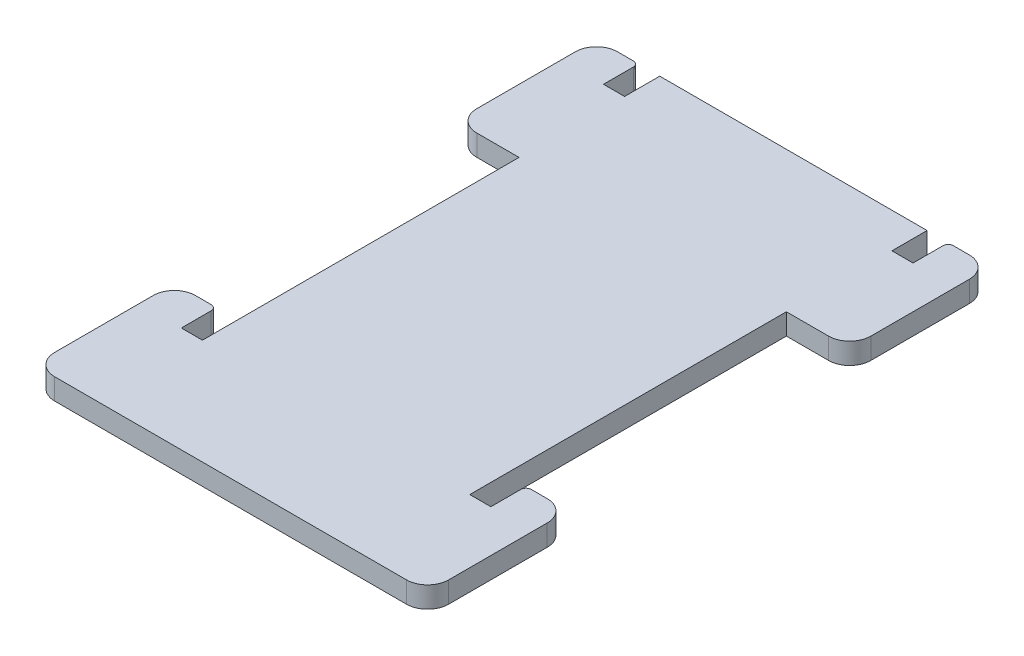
from build123d import *

# Parameters (mm, degrees)
BOSS_EXTRUDE1_DEPTH = 3
FILLET1_R           = 3
FILLET2_R           = 0.75
FILLET3_R           = 3


with BuildPart() as part:
    # Sketch1 → Boss-Extrude1 (new body)
    with BuildSketch(Plane(origin=(0, 0, 0), x_dir=(1, 0, 0), z_dir=(0, 1, 0))):
        Polygon((0, 0), (38, 0), (41, 0), (47, 0), (47, 20), (41, 20), (41, 15), (38, 15), (38, 60), (41, 60), (47, 60), (47, 80), (41, 80), (41, 75), (38, 75), (38, 80), (0, 80), (0, 75), (-3, 75), (-3, 80), (-9, 80), (-9, 60), (-3, 60), (0, 60), (0, 15), (-3, 15), (-3, 20), (-9, 20), (-9, 0), (-3, 0), align=None)
    extrude(amount=BOSS_EXTRUDE1_DEPTH)

    # Fillet1
    fillet1_edges = [part.edges().sort_by_distance(p)[0] for p in [
        (-9, 1.5, -20),
        (-9, 1.5, -80),
        (47, 1.5, -80),
        (47, 1.5, -20),
    ]]
    fillet(fillet1_edges, radius=FILLET1_R)

    # Fillet2
    fillet2_edges = [part.edges().sort_by_distance(p)[0] for p in [
        (-3, 1.5, -20),
        (-3, 1.5, -80),
        (41, 1.5, -80),
        (41, 1.5, -20),
    ]]
    fillet(fillet2_edges, radius=FILLET2_R)

    # Fillet3
    fillet3_edges = [part.edges().sort_by_distance(p)[0] for p in [
        (-9, 1.5, 0),
        (-9, 1.5, -60),
        (47, 1.5, -60),
        (47, 1.5, 0),
    ]]
    fillet(fillet3_edges, radius=FILLET3_R)


solid = part.part
